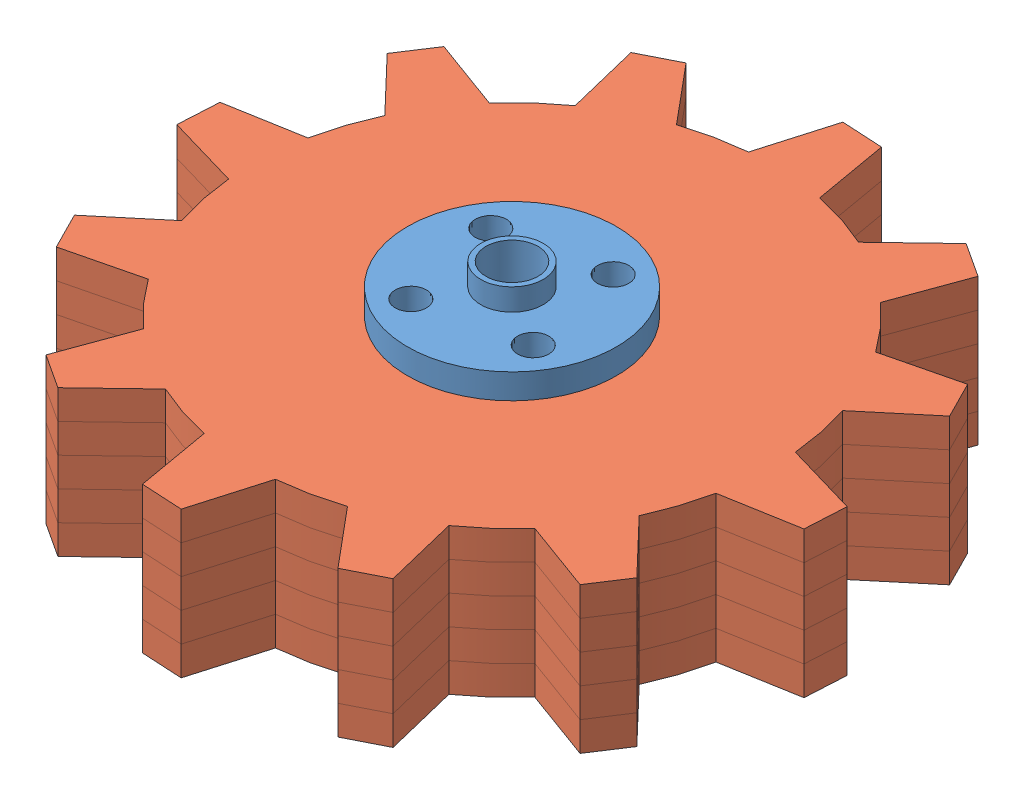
SolidWorks assembly Assem3.SLDASM, configuration Default (file format 12000). Lengths in mm.
Overall size (88.13 18.5 88.13).
6 component instances, 2 part files, 15 mates.
Components (placement in the parent):
- maz_flanch-1: maz_flanch.SLDPRT [Default] at (74.2164 37.1956 14.8264) x (0.978716 0 -0.20522) z (0.20522 0 0.978716) size (20 4.5 20)
- 2_buzo --2: 2_buzo -.SLDPRT [Default] at (74.2164 34.3955 14.8264) x (0.837169 0 0.546944) z (-0.546944 0 0.837169) size (63.67 2.8 63.67)
- 2_buzo --3: 2_buzo -.SLDPRT [Default] at (74.2164 34.3955 14.8264) x (-0.837169 0 -0.546944) z (-0.546944 0 0.837169) size (63.67 2.8 63.67)
- 2_buzo --4: 2_buzo -.SLDPRT [Default] at (74.2164 28.7955 14.8264) x (0.837169 0 0.546944) z (-0.546944 0 0.837169) size (63.67 2.8 63.67)
- 2_buzo --5: 2_buzo -.SLDPRT [Default] at (74.2164 25.9955 14.8264) x (0.837169 0 0.546944) z (-0.546944 0 0.837169) size (63.67 2.8 63.67)
- 2_buzo --6: 2_buzo -.SLDPRT [Default] at (74.2164 25.9955 14.8264) x (-0.837169 0 -0.546944) z (-0.546944 0 0.837169) size (63.67 2.8 63.67)
Mates (geometry in assembly coordinates):
- Concentric1: concentric anti-aligned: cylinder of 2_buzo --5 through (74.2164 18.7955 14.8264) axis (0 1 0) radius 1.5; cylinder of 2_buzo --6 through (74.2164 33.1955 14.8264) axis (0 -1 0) radius 1.5
- Concentric2: concentric anti-aligned: cylinder of 2_buzo --5 through (80.0766 18.7955 18.655) axis (0 1 0) radius 1.5; cylinder of 2_buzo --6 through (80.0766 33.1955 18.655) axis (0 -1 0) radius 1.5
- Coincident5: coincident anti-aligned: plane of 2_buzo --5 through (74.2164 25.9955 14.8264) normal (0 -1 0); plane of 2_buzo --6 through (74.2164 25.9955 14.8264) normal (0 1 0)
- Concentric3: concentric aligned: cylinder of 2_buzo --4 through (80.0766 21.5955 18.655) axis (0 1 0) radius 1.5; cylinder of 2_buzo --5 through (80.0766 18.7955 18.655) axis (0 1 0) radius 1.5
- Concentric4: concentric aligned: cylinder of 2_buzo --4 through (74.2164 21.5955 14.8264) axis (0 1 0) radius 1.5; cylinder of 2_buzo --5 through (74.2164 18.7955 14.8264) axis (0 1 0) radius 1.5
- Coincident6: coincident anti-aligned: plane of 2_buzo --4 through (74.2164 28.7955 14.8264) normal (0 -1 0); plane of 2_buzo --5 through (74.2164 28.7955 14.8264) normal (0 1 0)
- Concentric5: concentric anti-aligned: cylinder of 2_buzo --3 through (74.2164 41.5955 14.8264) axis (0 -1 0) radius 1.5; cylinder of 2_buzo --4 through (74.2164 21.5955 14.8264) axis (0 1 0) radius 1.5
- Coincident7: coincident anti-aligned: plane of 2_buzo --3 through (74.2164 31.5955 14.8264) normal (0 -1 0); plane of 2_buzo --4 through (74.2164 31.5955 14.8264) normal (0 1 0)
- Concentric6: concentric anti-aligned: cylinder of 2_buzo --2 through (74.2164 27.1955 14.8264) axis (0 1 0) radius 1.5; cylinder of 2_buzo --3 through (74.2164 41.5955 14.8264) axis (0 -1 0) radius 1.5
- Coincident9: coincident anti-aligned: plane of 2_buzo --2 through (74.2164 34.3955 14.8264) normal (0 -1 0); plane of 2_buzo --3 through (74.2164 34.3955 14.8264) normal (0 1 0)
- Concentric7: concentric anti-aligned: cylinder of 2_buzo --2 through (74.2164 27.1955 14.8264) axis (0 1 0) radius 1.5; cylinder of 2_buzo --3 through (74.2164 41.5955 14.8264) axis (0 -1 0) radius 1.5
- Concentric8: concentric anti-aligned: cylinder of 2_buzo --2 through (70.3878 27.1955 20.6866) axis (0 1 0) radius 1.5; cylinder of 2_buzo --3 through (70.3878 41.5955 20.6866) axis (0 -1 0) radius 1.5
- Concentric9: concentric aligned: cylinder of maz_flanch-1 through (70.3878 37.1955 20.6866) axis (0 1 0) radius 1.5; cylinder of 2_buzo --2 through (70.3878 27.1955 20.6866) axis (0 1 0) radius 1.5
- Concentric10: concentric aligned: cylinder of maz_flanch-1 through (78.045 37.1955 8.9662) axis (0 1 0) radius 1.5; cylinder of 2_buzo --2 through (78.045 27.1955 8.9662) axis (0 1 0) radius 1.5
- Coincident10: coincident anti-aligned: plane of maz_flanch-1 through (74.2164 37.1955 14.8264) normal (0 -1 0); plane of 2_buzo --2 through (74.2164 37.1955 14.8264) normal (0 1 0)
